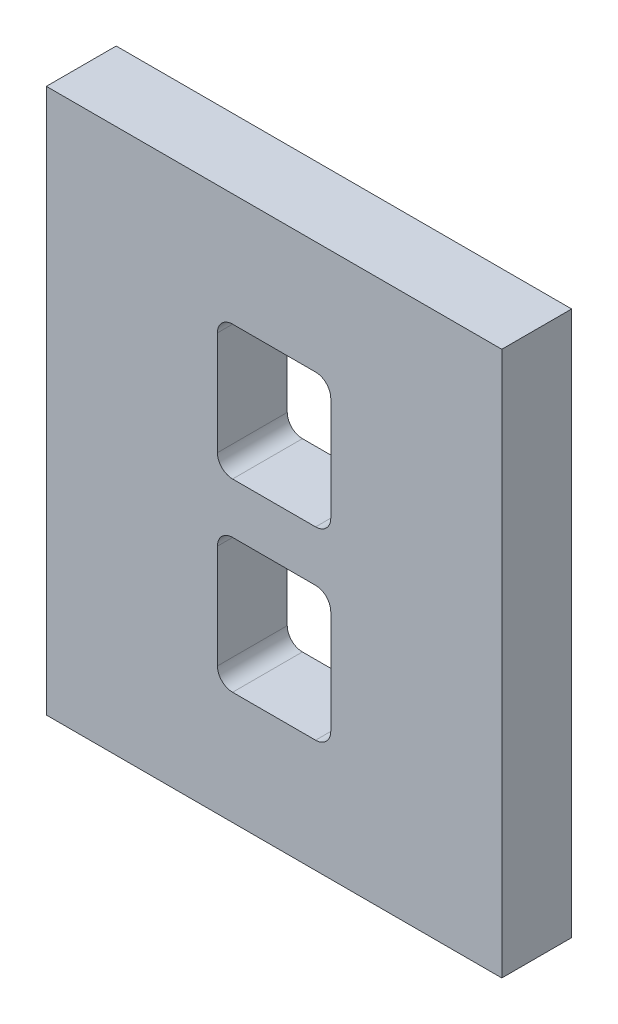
ISO-10303-21;
HEADER;
FILE_DESCRIPTION(('STEP AP214'),'2;1');
FILE_NAME('part.step','',(''),(''),'','','');
FILE_SCHEMA(('AUTOMOTIVE_DESIGN { 1 0 10303 214 1 1 1 1 }'));
ENDSEC;
DATA;
#1=APPLICATION_CONTEXT('core data for automotive mechanical design processes');
#2=APPLICATION_PROTOCOL_DEFINITION('international standard','automotive_design',2000,#1);
#3=PRODUCT_CONTEXT('',#1,'mechanical');
#4=PRODUCT('Part','Part','',(#3));
#5=PRODUCT_RELATED_PRODUCT_CATEGORY('part','',(#4));
#6=PRODUCT_DEFINITION_FORMATION('','',#4);
#7=PRODUCT_DEFINITION_CONTEXT('part definition',#1,'design');
#8=PRODUCT_DEFINITION('design','',#6,#7);
#9=PRODUCT_DEFINITION_SHAPE('','',#8);
#10=(LENGTH_UNIT() NAMED_UNIT(*) SI_UNIT(.MILLI.,.METRE.));
#11=(NAMED_UNIT(*) PLANE_ANGLE_UNIT() SI_UNIT($,.RADIAN.));
#12=(NAMED_UNIT(*) SI_UNIT($,.STERADIAN.) SOLID_ANGLE_UNIT());
#13=UNCERTAINTY_MEASURE_WITH_UNIT(LENGTH_MEASURE(1.E-05),#10,'distance_accuracy_value','');
#14=(GEOMETRIC_REPRESENTATION_CONTEXT(3) GLOBAL_UNCERTAINTY_ASSIGNED_CONTEXT((#13)) GLOBAL_UNIT_ASSIGNED_CONTEXT((#10,
#11,#12)) REPRESENTATION_CONTEXT('',''));
#15=CARTESIAN_POINT('',(0.,0.,0.));
#16=DIRECTION('',(0.,0.,1.));
#17=DIRECTION('',(1.,0.,0.));
#18=AXIS2_PLACEMENT_3D('',#15,#16,#17);
#19=CARTESIAN_POINT('',(0.,0.,8.763));
#20=DIRECTION('',(1.,0.,0.));
#21=DIRECTION('',(0.,0.,-1.));
#22=AXIS2_PLACEMENT_3D('',#19,#20,#21);
#23=PLANE('',#22);
#24=DIRECTION('',(0.,-1.,0.));
#25=VECTOR('',#24,1.);
#26=CARTESIAN_POINT('',(0.,0.,0.));
#27=LINE('',#26,#25);
#28=CARTESIAN_POINT('',(0.,68.326,0.));
#29=VERTEX_POINT('',#28);
#30=CARTESIAN_POINT('',(0.,0.,0.));
#31=VERTEX_POINT('',#30);
#32=EDGE_CURVE('E286',#29,#31,#27,.T.);
#33=ORIENTED_EDGE('',*,*,#32,.T.);
#34=DIRECTION('',(0.,0.,-1.));
#35=VECTOR('',#34,1.);
#36=CARTESIAN_POINT('',(0.,0.,8.763));
#37=LINE('',#36,#35);
#38=CARTESIAN_POINT('',(0.,0.,8.763));
#39=VERTEX_POINT('',#38);
#40=EDGE_CURVE('E11',#39,#31,#37,.T.);
#41=ORIENTED_EDGE('',*,*,#40,.F.);
#42=DIRECTION('',(0.,-1.,0.));
#43=VECTOR('',#42,1.);
#44=CARTESIAN_POINT('',(0.,0.,8.763));
#45=LINE('',#44,#43);
#46=CARTESIAN_POINT('',(0.,68.326,8.763));
#47=VERTEX_POINT('',#46);
#48=EDGE_CURVE('E301',#47,#39,#45,.T.);
#49=ORIENTED_EDGE('',*,*,#48,.F.);
#50=DIRECTION('',(0.,0.,-1.));
#51=VECTOR('',#50,1.);
#52=CARTESIAN_POINT('',(0.,68.326,8.763));
#53=LINE('',#52,#51);
#54=EDGE_CURVE('E311',#47,#29,#53,.T.);
#55=ORIENTED_EDGE('',*,*,#54,.T.);
#56=EDGE_LOOP('',(#33,#41,#49,#55));
#57=FACE_BOUND('',#56,.T.);
#58=ADVANCED_FACE('F32',(#57),#23,.F.);
#59=CARTESIAN_POINT('',(0.,0.,8.763));
#60=DIRECTION('',(0.,1.,0.));
#61=DIRECTION('',(0.,0.,1.));
#62=AXIS2_PLACEMENT_3D('',#59,#60,#61);
#63=PLANE('',#62);
#64=DIRECTION('',(1.,0.,0.));
#65=VECTOR('',#64,1.);
#66=CARTESIAN_POINT('',(0.,0.,0.));
#67=LINE('',#66,#65);
#68=CARTESIAN_POINT('',(57.15,0.,0.));
#69=VERTEX_POINT('',#68);
#70=EDGE_CURVE('E314',#31,#69,#67,.T.);
#71=ORIENTED_EDGE('',*,*,#70,.T.);
#72=DIRECTION('',(0.,0.,-1.));
#73=VECTOR('',#72,1.);
#74=CARTESIAN_POINT('',(57.15,0.,8.763));
#75=LINE('',#74,#73);
#76=CARTESIAN_POINT('',(57.15,0.,8.763));
#77=VERTEX_POINT('',#76);
#78=EDGE_CURVE('E39',#77,#69,#75,.T.);
#79=ORIENTED_EDGE('',*,*,#78,.F.);
#80=DIRECTION('',(1.,0.,0.));
#81=VECTOR('',#80,1.);
#82=CARTESIAN_POINT('',(0.,0.,8.763));
#83=LINE('',#82,#81);
#84=EDGE_CURVE('E304',#39,#77,#83,.T.);
#85=ORIENTED_EDGE('',*,*,#84,.F.);
#86=ORIENTED_EDGE('',*,*,#40,.T.);
#87=EDGE_LOOP('',(#71,#79,#85,#86));
#88=FACE_BOUND('',#87,.T.);
#89=ADVANCED_FACE('F343',(#88),#63,.F.);
#90=CARTESIAN_POINT('',(57.15,0.,8.763));
#91=DIRECTION('',(-1.,0.,0.));
#92=DIRECTION('',(0.,0.,1.));
#93=AXIS2_PLACEMENT_3D('',#90,#91,#92);
#94=PLANE('',#93);
#95=DIRECTION('',(0.,1.,0.));
#96=VECTOR('',#95,1.);
#97=CARTESIAN_POINT('',(57.15,0.,0.));
#98=LINE('',#97,#96);
#99=CARTESIAN_POINT('',(57.15,68.326,0.));
#100=VERTEX_POINT('',#99);
#101=EDGE_CURVE('E316',#69,#100,#98,.T.);
#102=ORIENTED_EDGE('',*,*,#101,.T.);
#103=DIRECTION('',(0.,0.,-1.));
#104=VECTOR('',#103,1.);
#105=CARTESIAN_POINT('',(57.15,68.326,8.763));
#106=LINE('',#105,#104);
#107=CARTESIAN_POINT('',(57.15,68.326,8.763));
#108=VERTEX_POINT('',#107);
#109=EDGE_CURVE('E321',#108,#100,#106,.T.);
#110=ORIENTED_EDGE('',*,*,#109,.F.);
#111=DIRECTION('',(0.,1.,0.));
#112=VECTOR('',#111,1.);
#113=CARTESIAN_POINT('',(57.15,0.,8.763));
#114=LINE('',#113,#112);
#115=EDGE_CURVE('E307',#77,#108,#114,.T.);
#116=ORIENTED_EDGE('',*,*,#115,.F.);
#117=ORIENTED_EDGE('',*,*,#78,.T.);
#118=EDGE_LOOP('',(#102,#110,#116,#117));
#119=FACE_BOUND('',#118,.T.);
#120=ADVANCED_FACE('F328',(#119),#94,.F.);
#121=CARTESIAN_POINT('',(0.,68.326,8.763));
#122=DIRECTION('',(0.,-1.,0.));
#123=DIRECTION('',(0.,0.,-1.));
#124=AXIS2_PLACEMENT_3D('',#121,#122,#123);
#125=PLANE('',#124);
#126=DIRECTION('',(-1.,0.,0.));
#127=VECTOR('',#126,1.);
#128=CARTESIAN_POINT('',(0.,68.326,0.));
#129=LINE('',#128,#127);
#130=EDGE_CURVE('E305',#100,#29,#129,.T.);
#131=ORIENTED_EDGE('',*,*,#130,.T.);
#132=ORIENTED_EDGE('',*,*,#54,.F.);
#133=DIRECTION('',(-1.,0.,0.));
#134=VECTOR('',#133,1.);
#135=CARTESIAN_POINT('',(0.,68.326,8.763));
#136=LINE('',#135,#134);
#137=EDGE_CURVE('E309',#108,#47,#136,.T.);
#138=ORIENTED_EDGE('',*,*,#137,.F.);
#139=ORIENTED_EDGE('',*,*,#109,.T.);
#140=EDGE_LOOP('',(#131,#132,#138,#139));
#141=FACE_BOUND('',#140,.T.);
#142=ADVANCED_FACE('F336',(#141),#125,.F.);
#143=CARTESIAN_POINT('',(0.,68.326,8.763));
#144=DIRECTION('',(0.,0.,-1.));
#145=DIRECTION('',(-1.,0.,0.));
#146=AXIS2_PLACEMENT_3D('',#143,#144,#145);
#147=PLANE('',#146);
#148=DIRECTION('',(1.,0.,0.));
#149=VECTOR('',#148,1.);
#150=CARTESIAN_POINT('',(23.368,37.338,8.763));
#151=LINE('',#150,#149);
#152=CARTESIAN_POINT('',(23.368,37.338,8.763));
#153=VERTEX_POINT('',#152);
#154=CARTESIAN_POINT('',(33.7820000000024,37.338,8.763));
#155=VERTEX_POINT('',#154);
#156=EDGE_CURVE('E207',#153,#155,#151,.T.);
#157=ORIENTED_EDGE('',*,*,#156,.F.);
#158=CARTESIAN_POINT('',(23.368,39.243,8.763));
#159=DIRECTION('',(0.,0.,1.));
#160=DIRECTION('',(1.,0.,0.));
#161=AXIS2_PLACEMENT_3D('',#158,#159,#160);
#162=CIRCLE('',#161,1.905);
#163=CARTESIAN_POINT('',(21.463,39.243,8.763));
#164=VERTEX_POINT('',#163);
#165=EDGE_CURVE('E46',#164,#153,#162,.T.);
#166=ORIENTED_EDGE('',*,*,#165,.F.);
#167=DIRECTION('',(0.,-1.,0.));
#168=VECTOR('',#167,1.);
#169=CARTESIAN_POINT('',(21.463,52.2605,8.763));
#170=LINE('',#169,#168);
#171=CARTESIAN_POINT('',(21.463,52.2605,8.763));
#172=VERTEX_POINT('',#171);
#173=EDGE_CURVE('E187',#172,#164,#170,.T.);
#174=ORIENTED_EDGE('',*,*,#173,.F.);
#175=CARTESIAN_POINT('',(23.368,52.2605,8.763));
#176=DIRECTION('',(0.,0.,1.));
#177=DIRECTION('',(1.,0.,0.));
#178=AXIS2_PLACEMENT_3D('',#175,#176,#177);
#179=CIRCLE('',#178,1.905);
#180=CARTESIAN_POINT('',(23.368,54.1655,8.763));
#181=VERTEX_POINT('',#180);
#182=EDGE_CURVE('E190',#181,#172,#179,.T.);
#183=ORIENTED_EDGE('',*,*,#182,.F.);
#184=DIRECTION('',(-1.,0.,0.));
#185=VECTOR('',#184,1.);
#186=CARTESIAN_POINT('',(23.368,54.1655,8.763));
#187=LINE('',#186,#185);
#188=CARTESIAN_POINT('',(33.7820000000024,54.1655,8.763));
#189=VERTEX_POINT('',#188);
#190=EDGE_CURVE('E218',#189,#181,#187,.T.);
#191=ORIENTED_EDGE('',*,*,#190,.F.);
#192=CARTESIAN_POINT('',(33.7820000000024,52.2605,8.763));
#193=DIRECTION('',(0.,0.,1.));
#194=DIRECTION('',(-1.,0.,0.));
#195=AXIS2_PLACEMENT_3D('',#192,#193,#194);
#196=CIRCLE('',#195,1.905);
#197=CARTESIAN_POINT('',(35.6870000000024,52.2605,8.763));
#198=VERTEX_POINT('',#197);
#199=EDGE_CURVE('E215',#198,#189,#196,.T.);
#200=ORIENTED_EDGE('',*,*,#199,.F.);
#201=DIRECTION('',(0.,1.,0.));
#202=VECTOR('',#201,1.);
#203=CARTESIAN_POINT('',(35.6870000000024,52.2605,8.763));
#204=LINE('',#203,#202);
#205=CARTESIAN_POINT('',(35.6870000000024,39.243,8.763));
#206=VERTEX_POINT('',#205);
#207=EDGE_CURVE('E212',#206,#198,#204,.T.);
#208=ORIENTED_EDGE('',*,*,#207,.F.);
#209=CARTESIAN_POINT('',(33.7820000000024,39.243,8.763));
#210=DIRECTION('',(0.,0.,1.));
#211=DIRECTION('',(1.,0.,0.));
#212=AXIS2_PLACEMENT_3D('',#209,#210,#211);
#213=CIRCLE('',#212,1.905);
#214=EDGE_CURVE('E209',#155,#206,#213,.T.);
#215=ORIENTED_EDGE('',*,*,#214,.F.);
#216=EDGE_LOOP('',(#157,#166,#174,#183,#191,#200,#208,#215));
#217=FACE_BOUND('',#216,.T.);
#218=DIRECTION('',(1.,0.,0.));
#219=VECTOR('',#218,1.);
#220=CARTESIAN_POINT('',(23.368,14.1605,8.763));
#221=LINE('',#220,#219);
#222=CARTESIAN_POINT('',(23.368,14.1605,8.763));
#223=VERTEX_POINT('',#222);
#224=CARTESIAN_POINT('',(33.7820000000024,14.1605,8.763));
#225=VERTEX_POINT('',#224);
#226=EDGE_CURVE('E264',#223,#225,#221,.T.);
#227=ORIENTED_EDGE('',*,*,#226,.F.);
#228=CARTESIAN_POINT('',(23.368,16.0655,8.763));
#229=DIRECTION('',(0.,0.,1.));
#230=DIRECTION('',(-1.,0.,0.));
#231=AXIS2_PLACEMENT_3D('',#228,#229,#230);
#232=CIRCLE('',#231,1.905);
#233=CARTESIAN_POINT('',(21.463,16.0655,8.763));
#234=VERTEX_POINT('',#233);
#235=EDGE_CURVE('E225',#234,#223,#232,.T.);
#236=ORIENTED_EDGE('',*,*,#235,.F.);
#237=DIRECTION('',(0.,-1.,0.));
#238=VECTOR('',#237,1.);
#239=CARTESIAN_POINT('',(21.463,16.0655,8.763));
#240=LINE('',#239,#238);
#241=CARTESIAN_POINT('',(21.463,29.083,8.763));
#242=VERTEX_POINT('',#241);
#243=EDGE_CURVE('E241',#242,#234,#240,.T.);
#244=ORIENTED_EDGE('',*,*,#243,.F.);
#245=CARTESIAN_POINT('',(23.368,29.083,8.763));
#246=DIRECTION('',(0.,0.,1.));
#247=DIRECTION('',(-1.,0.,0.));
#248=AXIS2_PLACEMENT_3D('',#245,#246,#247);
#249=CIRCLE('',#248,1.905);
#250=CARTESIAN_POINT('',(23.368,30.988,8.763));
#251=VERTEX_POINT('',#250);
#252=EDGE_CURVE('E279',#251,#242,#249,.T.);
#253=ORIENTED_EDGE('',*,*,#252,.F.);
#254=DIRECTION('',(-1.,0.,0.));
#255=VECTOR('',#254,1.);
#256=CARTESIAN_POINT('',(23.368,30.988,8.763));
#257=LINE('',#256,#255);
#258=CARTESIAN_POINT('',(33.7820000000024,30.988,8.763));
#259=VERTEX_POINT('',#258);
#260=EDGE_CURVE('E276',#259,#251,#257,.T.);
#261=ORIENTED_EDGE('',*,*,#260,.F.);
#262=CARTESIAN_POINT('',(33.7820000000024,29.083,8.763));
#263=DIRECTION('',(0.,0.,1.));
#264=DIRECTION('',(-1.,0.,0.));
#265=AXIS2_PLACEMENT_3D('',#262,#263,#264);
#266=CIRCLE('',#265,1.905);
#267=CARTESIAN_POINT('',(35.6870000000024,29.083,8.763));
#268=VERTEX_POINT('',#267);
#269=EDGE_CURVE('E273',#268,#259,#266,.T.);
#270=ORIENTED_EDGE('',*,*,#269,.F.);
#271=DIRECTION('',(0.,1.,0.));
#272=VECTOR('',#271,1.);
#273=CARTESIAN_POINT('',(35.6870000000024,16.0655,8.763));
#274=LINE('',#273,#272);
#275=CARTESIAN_POINT('',(35.6870000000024,16.0655,8.763));
#276=VERTEX_POINT('',#275);
#277=EDGE_CURVE('E270',#276,#268,#274,.T.);
#278=ORIENTED_EDGE('',*,*,#277,.F.);
#279=CARTESIAN_POINT('',(33.7820000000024,16.0655,8.763));
#280=DIRECTION('',(0.,0.,1.));
#281=DIRECTION('',(1.,0.,0.));
#282=AXIS2_PLACEMENT_3D('',#279,#280,#281);
#283=CIRCLE('',#282,1.905);
#284=EDGE_CURVE('E267',#225,#276,#283,.T.);
#285=ORIENTED_EDGE('',*,*,#284,.F.);
#286=EDGE_LOOP('',(#227,#236,#244,#253,#261,#270,#278,#285));
#287=FACE_BOUND('',#286,.T.);
#288=ORIENTED_EDGE('',*,*,#48,.T.);
#289=ORIENTED_EDGE('',*,*,#84,.T.);
#290=ORIENTED_EDGE('',*,*,#115,.T.);
#291=ORIENTED_EDGE('',*,*,#137,.T.);
#292=EDGE_LOOP('',(#288,#289,#290,#291));
#293=FACE_BOUND('',#292,.T.);
#294=ADVANCED_FACE('F342',(#217,#287,#293),#147,.F.);
#295=CARTESIAN_POINT('',(0.,68.326,0.));
#296=DIRECTION('',(0.,0.,-1.));
#297=DIRECTION('',(-1.,0.,0.));
#298=AXIS2_PLACEMENT_3D('',#295,#296,#297);
#299=PLANE('',#298);
#300=CARTESIAN_POINT('',(23.368,39.243,0.));
#301=DIRECTION('',(0.,0.,1.));
#302=DIRECTION('',(1.,0.,0.));
#303=AXIS2_PLACEMENT_3D('',#300,#301,#302);
#304=CIRCLE('',#303,1.905);
#305=CARTESIAN_POINT('',(21.463,39.243,0.));
#306=VERTEX_POINT('',#305);
#307=CARTESIAN_POINT('',(23.368,37.338,0.));
#308=VERTEX_POINT('',#307);
#309=EDGE_CURVE('E170',#306,#308,#304,.T.);
#310=ORIENTED_EDGE('',*,*,#309,.T.);
#311=DIRECTION('',(1.,0.,0.));
#312=VECTOR('',#311,1.);
#313=CARTESIAN_POINT('',(23.368,37.338,0.));
#314=LINE('',#313,#312);
#315=CARTESIAN_POINT('',(33.7820000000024,37.338,0.));
#316=VERTEX_POINT('',#315);
#317=EDGE_CURVE('E179',#308,#316,#314,.T.);
#318=ORIENTED_EDGE('',*,*,#317,.T.);
#319=CARTESIAN_POINT('',(33.7820000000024,39.243,0.));
#320=DIRECTION('',(0.,0.,1.));
#321=DIRECTION('',(1.,0.,0.));
#322=AXIS2_PLACEMENT_3D('',#319,#320,#321);
#323=CIRCLE('',#322,1.905);
#324=CARTESIAN_POINT('',(35.6870000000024,39.243,0.));
#325=VERTEX_POINT('',#324);
#326=EDGE_CURVE('E54',#316,#325,#323,.T.);
#327=ORIENTED_EDGE('',*,*,#326,.T.);
#328=DIRECTION('',(0.,1.,0.));
#329=VECTOR('',#328,1.);
#330=CARTESIAN_POINT('',(35.6870000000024,52.2605,0.));
#331=LINE('',#330,#329);
#332=CARTESIAN_POINT('',(35.6870000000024,52.2605,0.));
#333=VERTEX_POINT('',#332);
#334=EDGE_CURVE('E194',#325,#333,#331,.T.);
#335=ORIENTED_EDGE('',*,*,#334,.T.);
#336=CARTESIAN_POINT('',(33.7820000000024,52.2605,0.));
#337=DIRECTION('',(0.,0.,1.));
#338=DIRECTION('',(-1.,0.,0.));
#339=AXIS2_PLACEMENT_3D('',#336,#337,#338);
#340=CIRCLE('',#339,1.905);
#341=CARTESIAN_POINT('',(33.7820000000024,54.1655,0.));
#342=VERTEX_POINT('',#341);
#343=EDGE_CURVE('E197',#333,#342,#340,.T.);
#344=ORIENTED_EDGE('',*,*,#343,.T.);
#345=DIRECTION('',(-1.,0.,0.));
#346=VECTOR('',#345,1.);
#347=CARTESIAN_POINT('',(23.368,54.1655,0.));
#348=LINE('',#347,#346);
#349=CARTESIAN_POINT('',(23.368,54.1655,0.));
#350=VERTEX_POINT('',#349);
#351=EDGE_CURVE('E200',#342,#350,#348,.T.);
#352=ORIENTED_EDGE('',*,*,#351,.T.);
#353=CARTESIAN_POINT('',(23.368,52.2605,0.));
#354=DIRECTION('',(0.,0.,1.));
#355=DIRECTION('',(1.,0.,0.));
#356=AXIS2_PLACEMENT_3D('',#353,#354,#355);
#357=CIRCLE('',#356,1.905);
#358=CARTESIAN_POINT('',(21.463,52.2605,0.));
#359=VERTEX_POINT('',#358);
#360=EDGE_CURVE('E203',#350,#359,#357,.T.);
#361=ORIENTED_EDGE('',*,*,#360,.T.);
#362=DIRECTION('',(0.,-1.,0.));
#363=VECTOR('',#362,1.);
#364=CARTESIAN_POINT('',(21.463,52.2605,0.));
#365=LINE('',#364,#363);
#366=EDGE_CURVE('E176',#359,#306,#365,.T.);
#367=ORIENTED_EDGE('',*,*,#366,.T.);
#368=EDGE_LOOP('',(#310,#318,#327,#335,#344,#352,#361,#367));
#369=FACE_BOUND('',#368,.T.);
#370=CARTESIAN_POINT('',(23.368,16.0655,0.));
#371=DIRECTION('',(0.,0.,1.));
#372=DIRECTION('',(-1.,0.,0.));
#373=AXIS2_PLACEMENT_3D('',#370,#371,#372);
#374=CIRCLE('',#373,1.905);
#375=CARTESIAN_POINT('',(21.463,16.0655,0.));
#376=VERTEX_POINT('',#375);
#377=CARTESIAN_POINT('',(23.368,14.1605,0.));
#378=VERTEX_POINT('',#377);
#379=EDGE_CURVE('E237',#376,#378,#374,.T.);
#380=ORIENTED_EDGE('',*,*,#379,.T.);
#381=DIRECTION('',(1.,0.,0.));
#382=VECTOR('',#381,1.);
#383=CARTESIAN_POINT('',(23.368,14.1605,0.));
#384=LINE('',#383,#382);
#385=CARTESIAN_POINT('',(33.7820000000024,14.1605,0.));
#386=VERTEX_POINT('',#385);
#387=EDGE_CURVE('E240',#378,#386,#384,.T.);
#388=ORIENTED_EDGE('',*,*,#387,.T.);
#389=CARTESIAN_POINT('',(33.7820000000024,16.0655,0.));
#390=DIRECTION('',(0.,0.,1.));
#391=DIRECTION('',(1.,0.,0.));
#392=AXIS2_PLACEMENT_3D('',#389,#390,#391);
#393=CIRCLE('',#392,1.905);
#394=CARTESIAN_POINT('',(35.6870000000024,16.0655,0.));
#395=VERTEX_POINT('',#394);
#396=EDGE_CURVE('E244',#386,#395,#393,.T.);
#397=ORIENTED_EDGE('',*,*,#396,.T.);
#398=DIRECTION('',(0.,1.,0.));
#399=VECTOR('',#398,1.);
#400=CARTESIAN_POINT('',(35.6870000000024,16.0655,0.));
#401=LINE('',#400,#399);
#402=CARTESIAN_POINT('',(35.6870000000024,29.083,0.));
#403=VERTEX_POINT('',#402);
#404=EDGE_CURVE('E247',#395,#403,#401,.T.);
#405=ORIENTED_EDGE('',*,*,#404,.T.);
#406=CARTESIAN_POINT('',(33.7820000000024,29.083,0.));
#407=DIRECTION('',(0.,0.,1.));
#408=DIRECTION('',(-1.,0.,0.));
#409=AXIS2_PLACEMENT_3D('',#406,#407,#408);
#410=CIRCLE('',#409,1.905);
#411=CARTESIAN_POINT('',(33.7820000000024,30.988,0.));
#412=VERTEX_POINT('',#411);
#413=EDGE_CURVE('E250',#403,#412,#410,.T.);
#414=ORIENTED_EDGE('',*,*,#413,.T.);
#415=DIRECTION('',(-1.,0.,0.));
#416=VECTOR('',#415,1.);
#417=CARTESIAN_POINT('',(23.368,30.988,0.));
#418=LINE('',#417,#416);
#419=CARTESIAN_POINT('',(23.368,30.988,0.));
#420=VERTEX_POINT('',#419);
#421=EDGE_CURVE('E253',#412,#420,#418,.T.);
#422=ORIENTED_EDGE('',*,*,#421,.T.);
#423=CARTESIAN_POINT('',(23.368,29.083,0.));
#424=DIRECTION('',(0.,0.,1.));
#425=DIRECTION('',(-1.,0.,0.));
#426=AXIS2_PLACEMENT_3D('',#423,#424,#425);
#427=CIRCLE('',#426,1.905);
#428=CARTESIAN_POINT('',(21.463,29.083,0.));
#429=VERTEX_POINT('',#428);
#430=EDGE_CURVE('E256',#420,#429,#427,.T.);
#431=ORIENTED_EDGE('',*,*,#430,.T.);
#432=DIRECTION('',(0.,-1.,0.));
#433=VECTOR('',#432,1.);
#434=CARTESIAN_POINT('',(21.463,16.0655,0.));
#435=LINE('',#434,#433);
#436=EDGE_CURVE('E259',#429,#376,#435,.T.);
#437=ORIENTED_EDGE('',*,*,#436,.T.);
#438=EDGE_LOOP('',(#380,#388,#397,#405,#414,#422,#431,#437));
#439=FACE_BOUND('',#438,.T.);
#440=ORIENTED_EDGE('',*,*,#32,.F.);
#441=ORIENTED_EDGE('',*,*,#130,.F.);
#442=ORIENTED_EDGE('',*,*,#101,.F.);
#443=ORIENTED_EDGE('',*,*,#70,.F.);
#444=EDGE_LOOP('',(#440,#441,#442,#443));
#445=FACE_BOUND('',#444,.T.);
#446=ADVANCED_FACE('F183',(#369,#439,#445),#299,.T.);
#447=CARTESIAN_POINT('',(23.368,16.0655,0.));
#448=DIRECTION('',(0.,0.,1.));
#449=DIRECTION('',(1.,0.,0.));
#450=AXIS2_PLACEMENT_3D('',#447,#448,#449);
#451=CYLINDRICAL_SURFACE('',#450,1.905);
#452=ORIENTED_EDGE('',*,*,#235,.T.);
#453=DIRECTION('',(0.,0.,1.));
#454=VECTOR('',#453,1.);
#455=CARTESIAN_POINT('',(23.368,14.1605,0.));
#456=LINE('',#455,#454);
#457=EDGE_CURVE('E262',#378,#223,#456,.T.);
#458=ORIENTED_EDGE('',*,*,#457,.F.);
#459=ORIENTED_EDGE('',*,*,#379,.F.);
#460=DIRECTION('',(0.,0.,1.));
#461=VECTOR('',#460,1.);
#462=CARTESIAN_POINT('',(21.463,16.0655,0.));
#463=LINE('',#462,#461);
#464=EDGE_CURVE('E284',#376,#234,#463,.T.);
#465=ORIENTED_EDGE('',*,*,#464,.T.);
#466=EDGE_LOOP('',(#452,#458,#459,#465));
#467=FACE_BOUND('',#466,.T.);
#468=ADVANCED_FACE('F355',(#467),#451,.F.);
#469=CARTESIAN_POINT('',(21.463,16.0655,0.));
#470=DIRECTION('',(-1.,0.,0.));
#471=DIRECTION('',(0.,0.,1.));
#472=AXIS2_PLACEMENT_3D('',#469,#470,#471);
#473=PLANE('',#472);
#474=ORIENTED_EDGE('',*,*,#243,.T.);
#475=ORIENTED_EDGE('',*,*,#464,.F.);
#476=ORIENTED_EDGE('',*,*,#436,.F.);
#477=DIRECTION('',(0.,0.,1.));
#478=VECTOR('',#477,1.);
#479=CARTESIAN_POINT('',(21.463,29.083,0.));
#480=LINE('',#479,#478);
#481=EDGE_CURVE('E287',#429,#242,#480,.T.);
#482=ORIENTED_EDGE('',*,*,#481,.T.);
#483=EDGE_LOOP('',(#474,#475,#476,#482));
#484=FACE_BOUND('',#483,.T.);
#485=ADVANCED_FACE('F361',(#484),#473,.F.);
#486=CARTESIAN_POINT('',(23.368,29.083,0.));
#487=DIRECTION('',(0.,0.,1.));
#488=DIRECTION('',(1.,0.,0.));
#489=AXIS2_PLACEMENT_3D('',#486,#487,#488);
#490=CYLINDRICAL_SURFACE('',#489,1.905);
#491=ORIENTED_EDGE('',*,*,#252,.T.);
#492=ORIENTED_EDGE('',*,*,#481,.F.);
#493=ORIENTED_EDGE('',*,*,#430,.F.);
#494=DIRECTION('',(0.,0.,1.));
#495=VECTOR('',#494,1.);
#496=CARTESIAN_POINT('',(23.368,30.988,0.));
#497=LINE('',#496,#495);
#498=EDGE_CURVE('E289',#420,#251,#497,.T.);
#499=ORIENTED_EDGE('',*,*,#498,.T.);
#500=EDGE_LOOP('',(#491,#492,#493,#499));
#501=FACE_BOUND('',#500,.T.);
#502=ADVANCED_FACE('F382',(#501),#490,.F.);
#503=CARTESIAN_POINT('',(23.368,30.988,0.));
#504=DIRECTION('',(0.,1.,0.));
#505=DIRECTION('',(0.,0.,1.));
#506=AXIS2_PLACEMENT_3D('',#503,#504,#505);
#507=PLANE('',#506);
#508=ORIENTED_EDGE('',*,*,#260,.T.);
#509=ORIENTED_EDGE('',*,*,#498,.F.);
#510=ORIENTED_EDGE('',*,*,#421,.F.);
#511=DIRECTION('',(0.,0.,1.));
#512=VECTOR('',#511,1.);
#513=CARTESIAN_POINT('',(33.7820000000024,30.988,0.));
#514=LINE('',#513,#512);
#515=EDGE_CURVE('E291',#412,#259,#514,.T.);
#516=ORIENTED_EDGE('',*,*,#515,.T.);
#517=EDGE_LOOP('',(#508,#509,#510,#516));
#518=FACE_BOUND('',#517,.T.);
#519=ADVANCED_FACE('F378',(#518),#507,.F.);
#520=CARTESIAN_POINT('',(33.7820000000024,29.083,0.));
#521=DIRECTION('',(0.,0.,1.));
#522=DIRECTION('',(1.,0.,0.));
#523=AXIS2_PLACEMENT_3D('',#520,#521,#522);
#524=CYLINDRICAL_SURFACE('',#523,1.905);
#525=ORIENTED_EDGE('',*,*,#269,.T.);
#526=ORIENTED_EDGE('',*,*,#515,.F.);
#527=ORIENTED_EDGE('',*,*,#413,.F.);
#528=DIRECTION('',(0.,0.,1.));
#529=VECTOR('',#528,1.);
#530=CARTESIAN_POINT('',(35.6870000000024,29.083,0.));
#531=LINE('',#530,#529);
#532=EDGE_CURVE('E293',#403,#268,#531,.T.);
#533=ORIENTED_EDGE('',*,*,#532,.T.);
#534=EDGE_LOOP('',(#525,#526,#527,#533));
#535=FACE_BOUND('',#534,.T.);
#536=ADVANCED_FACE('F374',(#535),#524,.F.);
#537=CARTESIAN_POINT('',(35.6870000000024,16.0655,0.));
#538=DIRECTION('',(1.,0.,0.));
#539=DIRECTION('',(0.,0.,-1.));
#540=AXIS2_PLACEMENT_3D('',#537,#538,#539);
#541=PLANE('',#540);
#542=ORIENTED_EDGE('',*,*,#277,.T.);
#543=ORIENTED_EDGE('',*,*,#532,.F.);
#544=ORIENTED_EDGE('',*,*,#404,.F.);
#545=DIRECTION('',(0.,0.,1.));
#546=VECTOR('',#545,1.);
#547=CARTESIAN_POINT('',(35.6870000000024,16.0655,0.));
#548=LINE('',#547,#546);
#549=EDGE_CURVE('E295',#395,#276,#548,.T.);
#550=ORIENTED_EDGE('',*,*,#549,.T.);
#551=EDGE_LOOP('',(#542,#543,#544,#550));
#552=FACE_BOUND('',#551,.T.);
#553=ADVANCED_FACE('F370',(#552),#541,.F.);
#554=CARTESIAN_POINT('',(33.7820000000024,16.0655,0.));
#555=DIRECTION('',(0.,0.,1.));
#556=DIRECTION('',(1.,0.,0.));
#557=AXIS2_PLACEMENT_3D('',#554,#555,#556);
#558=CYLINDRICAL_SURFACE('',#557,1.905);
#559=ORIENTED_EDGE('',*,*,#284,.T.);
#560=ORIENTED_EDGE('',*,*,#549,.F.);
#561=ORIENTED_EDGE('',*,*,#396,.F.);
#562=DIRECTION('',(0.,0.,1.));
#563=VECTOR('',#562,1.);
#564=CARTESIAN_POINT('',(33.7820000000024,14.1605,0.));
#565=LINE('',#564,#563);
#566=EDGE_CURVE('E297',#386,#225,#565,.T.);
#567=ORIENTED_EDGE('',*,*,#566,.T.);
#568=EDGE_LOOP('',(#559,#560,#561,#567));
#569=FACE_BOUND('',#568,.T.);
#570=ADVANCED_FACE('F366',(#569),#558,.F.);
#571=CARTESIAN_POINT('',(23.368,14.1605,0.));
#572=DIRECTION('',(0.,-1.,0.));
#573=DIRECTION('',(0.,0.,-1.));
#574=AXIS2_PLACEMENT_3D('',#571,#572,#573);
#575=PLANE('',#574);
#576=ORIENTED_EDGE('',*,*,#226,.T.);
#577=ORIENTED_EDGE('',*,*,#566,.F.);
#578=ORIENTED_EDGE('',*,*,#387,.F.);
#579=ORIENTED_EDGE('',*,*,#457,.T.);
#580=EDGE_LOOP('',(#576,#577,#578,#579));
#581=FACE_BOUND('',#580,.T.);
#582=ADVANCED_FACE('F363',(#581),#575,.F.);
#583=CARTESIAN_POINT('',(23.368,39.243,0.));
#584=DIRECTION('',(0.,0.,1.));
#585=DIRECTION('',(1.,0.,0.));
#586=AXIS2_PLACEMENT_3D('',#583,#584,#585);
#587=CYLINDRICAL_SURFACE('',#586,1.905);
#588=ORIENTED_EDGE('',*,*,#165,.T.);
#589=DIRECTION('',(0.,0.,1.));
#590=VECTOR('',#589,1.);
#591=CARTESIAN_POINT('',(23.368,37.338,0.));
#592=LINE('',#591,#590);
#593=EDGE_CURVE('E166',#308,#153,#592,.T.);
#594=ORIENTED_EDGE('',*,*,#593,.F.);
#595=ORIENTED_EDGE('',*,*,#309,.F.);
#596=DIRECTION('',(0.,0.,1.));
#597=VECTOR('',#596,1.);
#598=CARTESIAN_POINT('',(21.463,39.243,0.));
#599=LINE('',#598,#597);
#600=EDGE_CURVE('E223',#306,#164,#599,.T.);
#601=ORIENTED_EDGE('',*,*,#600,.T.);
#602=EDGE_LOOP('',(#588,#594,#595,#601));
#603=FACE_BOUND('',#602,.T.);
#604=ADVANCED_FACE('F168',(#603),#587,.F.);
#605=CARTESIAN_POINT('',(21.463,52.2605,0.));
#606=DIRECTION('',(-1.,0.,0.));
#607=DIRECTION('',(0.,0.,1.));
#608=AXIS2_PLACEMENT_3D('',#605,#606,#607);
#609=PLANE('',#608);
#610=ORIENTED_EDGE('',*,*,#173,.T.);
#611=ORIENTED_EDGE('',*,*,#600,.F.);
#612=ORIENTED_EDGE('',*,*,#366,.F.);
#613=DIRECTION('',(0.,0.,1.));
#614=VECTOR('',#613,1.);
#615=CARTESIAN_POINT('',(21.463,52.2605,0.));
#616=LINE('',#615,#614);
#617=EDGE_CURVE('E226',#359,#172,#616,.T.);
#618=ORIENTED_EDGE('',*,*,#617,.T.);
#619=EDGE_LOOP('',(#610,#611,#612,#618));
#620=FACE_BOUND('',#619,.T.);
#621=ADVANCED_FACE('F392',(#620),#609,.F.);
#622=CARTESIAN_POINT('',(23.368,52.2605,0.));
#623=DIRECTION('',(0.,0.,1.));
#624=DIRECTION('',(1.,0.,0.));
#625=AXIS2_PLACEMENT_3D('',#622,#623,#624);
#626=CYLINDRICAL_SURFACE('',#625,1.905);
#627=ORIENTED_EDGE('',*,*,#182,.T.);
#628=ORIENTED_EDGE('',*,*,#617,.F.);
#629=ORIENTED_EDGE('',*,*,#360,.F.);
#630=DIRECTION('',(0.,0.,1.));
#631=VECTOR('',#630,1.);
#632=CARTESIAN_POINT('',(23.368,54.1655,0.));
#633=LINE('',#632,#631);
#634=EDGE_CURVE('E228',#350,#181,#633,.T.);
#635=ORIENTED_EDGE('',*,*,#634,.T.);
#636=EDGE_LOOP('',(#627,#628,#629,#635));
#637=FACE_BOUND('',#636,.T.);
#638=ADVANCED_FACE('F409',(#637),#626,.F.);
#639=CARTESIAN_POINT('',(23.368,54.1655,0.));
#640=DIRECTION('',(0.,1.,0.));
#641=DIRECTION('',(0.,0.,1.));
#642=AXIS2_PLACEMENT_3D('',#639,#640,#641);
#643=PLANE('',#642);
#644=ORIENTED_EDGE('',*,*,#190,.T.);
#645=ORIENTED_EDGE('',*,*,#634,.F.);
#646=ORIENTED_EDGE('',*,*,#351,.F.);
#647=DIRECTION('',(0.,0.,1.));
#648=VECTOR('',#647,1.);
#649=CARTESIAN_POINT('',(33.7820000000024,54.1655,0.));
#650=LINE('',#649,#648);
#651=EDGE_CURVE('E230',#342,#189,#650,.T.);
#652=ORIENTED_EDGE('',*,*,#651,.T.);
#653=EDGE_LOOP('',(#644,#645,#646,#652));
#654=FACE_BOUND('',#653,.T.);
#655=ADVANCED_FACE('F405',(#654),#643,.F.);
#656=CARTESIAN_POINT('',(33.7820000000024,52.2605,0.));
#657=DIRECTION('',(0.,0.,1.));
#658=DIRECTION('',(1.,0.,0.));
#659=AXIS2_PLACEMENT_3D('',#656,#657,#658);
#660=CYLINDRICAL_SURFACE('',#659,1.905);
#661=ORIENTED_EDGE('',*,*,#199,.T.);
#662=ORIENTED_EDGE('',*,*,#651,.F.);
#663=ORIENTED_EDGE('',*,*,#343,.F.);
#664=DIRECTION('',(0.,0.,1.));
#665=VECTOR('',#664,1.);
#666=CARTESIAN_POINT('',(35.6870000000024,52.2605,0.));
#667=LINE('',#666,#665);
#668=EDGE_CURVE('E232',#333,#198,#667,.T.);
#669=ORIENTED_EDGE('',*,*,#668,.T.);
#670=EDGE_LOOP('',(#661,#662,#663,#669));
#671=FACE_BOUND('',#670,.T.);
#672=ADVANCED_FACE('F401',(#671),#660,.F.);
#673=CARTESIAN_POINT('',(35.6870000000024,52.2605,0.));
#674=DIRECTION('',(1.,0.,0.));
#675=DIRECTION('',(0.,0.,-1.));
#676=AXIS2_PLACEMENT_3D('',#673,#674,#675);
#677=PLANE('',#676);
#678=ORIENTED_EDGE('',*,*,#207,.T.);
#679=ORIENTED_EDGE('',*,*,#668,.F.);
#680=ORIENTED_EDGE('',*,*,#334,.F.);
#681=DIRECTION('',(0.,0.,1.));
#682=VECTOR('',#681,1.);
#683=CARTESIAN_POINT('',(35.6870000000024,39.243,0.));
#684=LINE('',#683,#682);
#685=EDGE_CURVE('E234',#325,#206,#684,.T.);
#686=ORIENTED_EDGE('',*,*,#685,.T.);
#687=EDGE_LOOP('',(#678,#679,#680,#686));
#688=FACE_BOUND('',#687,.T.);
#689=ADVANCED_FACE('F398',(#688),#677,.F.);
#690=CARTESIAN_POINT('',(33.7820000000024,39.243,0.));
#691=DIRECTION('',(0.,0.,1.));
#692=DIRECTION('',(1.,0.,0.));
#693=AXIS2_PLACEMENT_3D('',#690,#691,#692);
#694=CYLINDRICAL_SURFACE('',#693,1.905);
#695=ORIENTED_EDGE('',*,*,#214,.T.);
#696=ORIENTED_EDGE('',*,*,#685,.F.);
#697=ORIENTED_EDGE('',*,*,#326,.F.);
#698=DIRECTION('',(0.,0.,1.));
#699=VECTOR('',#698,1.);
#700=CARTESIAN_POINT('',(33.7820000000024,37.338,0.));
#701=LINE('',#700,#699);
#702=EDGE_CURVE('E175',#316,#155,#701,.T.);
#703=ORIENTED_EDGE('',*,*,#702,.T.);
#704=EDGE_LOOP('',(#695,#696,#697,#703));
#705=FACE_BOUND('',#704,.T.);
#706=ADVANCED_FACE('F395',(#705),#694,.F.);
#707=CARTESIAN_POINT('',(23.368,37.338,0.));
#708=DIRECTION('',(0.,-1.,0.));
#709=DIRECTION('',(0.,0.,-1.));
#710=AXIS2_PLACEMENT_3D('',#707,#708,#709);
#711=PLANE('',#710);
#712=ORIENTED_EDGE('',*,*,#156,.T.);
#713=ORIENTED_EDGE('',*,*,#702,.F.);
#714=ORIENTED_EDGE('',*,*,#317,.F.);
#715=ORIENTED_EDGE('',*,*,#593,.T.);
#716=EDGE_LOOP('',(#712,#713,#714,#715));
#717=FACE_BOUND('',#716,.T.);
#718=ADVANCED_FACE('F180',(#717),#711,.F.);
#719=CLOSED_SHELL('',(#58,#89,#120,#142,#294,#446,#468,#485,#502,#519,#536,#553,#570,#582,#604,
#621,#638,#655,#672,#689,#706,#718));
#720=MANIFOLD_SOLID_BREP('B2',#719);
#721=ADVANCED_BREP_SHAPE_REPRESENTATION('',(#18,#720),#14);
#722=SHAPE_DEFINITION_REPRESENTATION(#9,#721);
ENDSEC;
END-ISO-10303-21;
